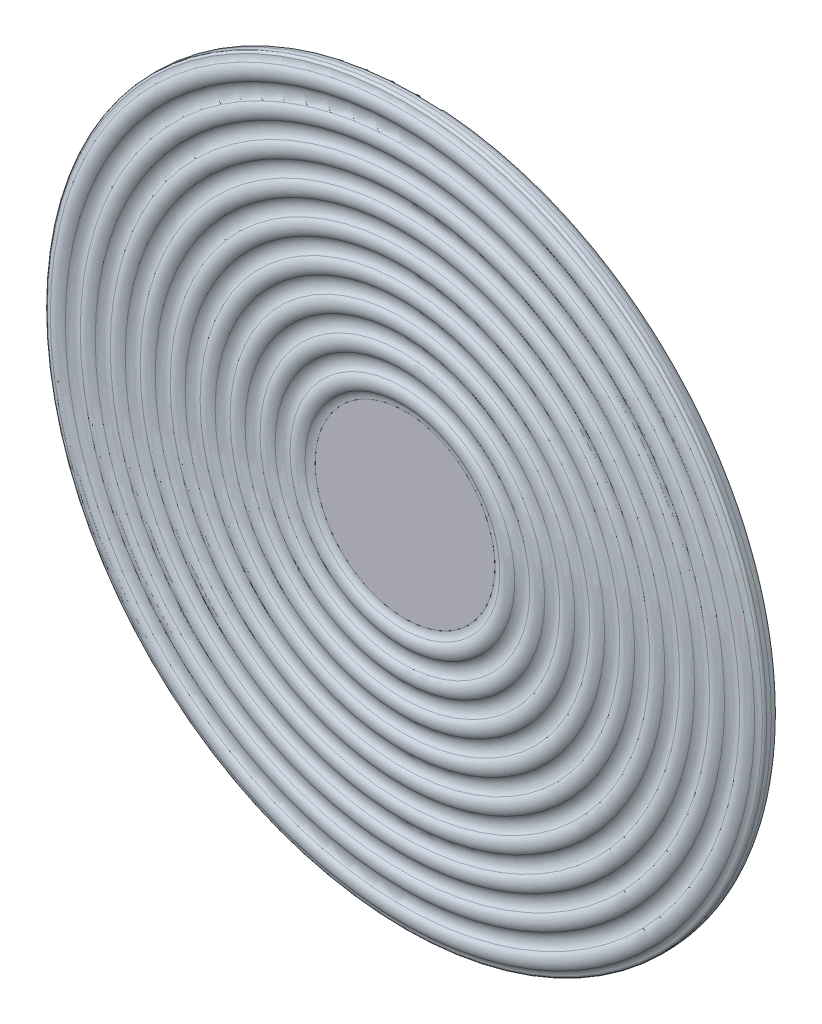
from build123d import *

# Parameters (mm, degrees)
CROQUIS1_R              = 50
SALIENTE_EXTRUIR1_DEPTH = 40
VACIADO1_T              = -3
CORTAR_EXTRUIR1_DEPTH   = 82.240384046
MATRIZL1_COUNT          = 3
MATRIZL1_PITCH          = 5
MATRIZL1_COL_COUNT      = 3
MATRIZL1_COL_PITCH      = 5
CROQUIS3_R              = 50
SALIENTE_EXTRUIR2_DEPTH = 26
CROQUIS5_R              = 37.5
SALIENTE_EXTRUIR3_DEPTH = 3
REDONDEO1_R             = 4
REDONDEO2_R             = 1


with BuildPart() as part:
    # Croquis1 → Saliente-Extruir1 (new body)
    with BuildSketch(Plane.XY):
        Circle(CROQUIS1_R)
    extrude(amount=SALIENTE_EXTRUIR1_DEPTH)

    # Vaciado1
    vaciado1_openings = [part.faces().sort_by_distance(p)[0] for p in [
        (0, 0, 0),
    ]]
    offset(amount=VACIADO1_T, openings=vaciado1_openings, kind=Kind.INTERSECTION)

    # Croquis2 → Cortar-Extruir1 (cut, symmetric)
    with BuildSketch(Plane(origin=(0, 0, 0), x_dir=(1, 0, 0), z_dir=(0, 1, 0))):
        with BuildLine():
            Line((-0.05, -10), (0.05, -10))
            ThreePointArc((0.05, -10), (0.898528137, -10.351471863), (1.25, -11.2))
            Line((1.25, -11.2), (1.25, -28.8))
            ThreePointArc((1.25, -28.8), (0.898528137, -29.648528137), (0.05, -30))
            Line((0.05, -30), (-0.05, -30))
            ThreePointArc((-0.05, -30), (-0.898528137, -29.648528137), (-1.25, -28.8))
            Line((-1.25, -28.8), (-1.25, -11.2))
            ThreePointArc((-1.25, -11.2), (-0.898528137, -10.351471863), (-0.05, -10))
        make_face()
    cortar_extruir1 = extrude(amount=CORTAR_EXTRUIR1_DEPTH, both=True, mode=Mode.SUBTRACT)

    # MatrizL1: Cortar-Extruir1 ×3
    with Locations(*[(i * MATRIZL1_PITCH, 0, 0) for i in range(1, MATRIZL1_COUNT)]):
        add(cortar_extruir1, mode=Mode.SUBTRACT)

    # MatrizL1 col: Cortar-Extruir1 ×3
    with Locations(*[(-i * MATRIZL1_COL_PITCH, 0, 0) for i in range(1, MATRIZL1_COL_COUNT)]):
        add(cortar_extruir1, mode=Mode.SUBTRACT)


with BuildPart() as body_2:
    # Croquis3 → Saliente-Extruir2 (new body)
    with BuildSketch(Plane.XY.offset(40)):
        with Locations(Location((0, 0, 0), (0, 0, 180))):
            Circle(CROQUIS3_R)
    extrude(amount=SALIENTE_EXTRUIR2_DEPTH)


with BuildPart() as body_3:
    # Croquis4 → Revoluci_n1 (revolve)
    with BuildSketch(Plane(origin=(0, 0, 0), x_dir=(0, 0, -1), z_dir=(1, 0, 0)), mode=Mode.PRIVATE) as revoluci_n1_sk:
        with BuildLine():
            Line((-72.806247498, 37.5), (-66, 37.5))
            Line((-66, 37.5), (-66, 150))
            Line((-66, 150), (-72.806247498, 150))
            ThreePointArc((-72.806247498, 150), (-73.088429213, 148.344043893), (-73.903123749, 146.875))
            ThreePointArc((-73.903123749, 146.875), (-75, 143.75), (-73.903123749, 140.625))
            ThreePointArc((-73.903123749, 140.625), (-72.806247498, 137.5), (-73.903123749, 134.375))
            ThreePointArc((-73.903123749, 134.375), (-75, 131.25), (-73.903123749, 128.125))
            ThreePointArc((-73.903123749, 128.125), (-72.806247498, 125), (-73.903123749, 121.875))
            ThreePointArc((-73.903123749, 121.875), (-75, 118.75), (-73.903123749, 115.625))
            ThreePointArc((-73.903123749, 115.625), (-72.806247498, 112.5), (-73.903123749, 109.375))
            ThreePointArc((-73.903123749, 109.375), (-75, 106.25), (-73.903123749, 103.125))
            ThreePointArc((-73.903123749, 103.125), (-72.806247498, 100), (-73.903123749, 96.875))
            ThreePointArc((-73.903123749, 96.875), (-75, 93.75), (-73.903123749, 90.625))
            ThreePointArc((-73.903123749, 90.625), (-72.806247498, 87.5), (-73.903123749, 84.375))
            ThreePointArc((-73.903123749, 84.375), (-75, 81.25), (-73.903123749, 78.125))
            ThreePointArc((-73.903123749, 78.125), (-72.806247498, 75), (-73.903123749, 71.875))
            ThreePointArc((-73.903123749, 71.875), (-75, 68.75), (-73.903123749, 65.625))
            ThreePointArc((-73.903123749, 65.625), (-72.806247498, 62.5), (-73.903123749, 59.375))
            ThreePointArc((-73.903123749, 59.375), (-75, 56.25), (-73.903123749, 53.125))
            ThreePointArc((-73.903123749, 53.125), (-72.806247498, 50), (-73.903123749, 46.875))
            ThreePointArc((-73.903123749, 46.875), (-75, 43.75), (-73.903123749, 40.625))
            ThreePointArc((-73.903123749, 40.625), (-73.088429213, 39.155956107), (-72.806247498, 37.5))
        make_face()
    revolve(revoluci_n1_sk.sketch.rotate(Axis((0, 0, 0), (0, 0, 1)), 90), axis=Axis((0, 0, 0), (0, 0, 1)))

    # Redondeo1
    redondeo1_edges = [body_3.edges().sort_by_distance(p)[0] for p in [
        (150, 0, 66),
    ]]
    fillet(redondeo1_edges, radius=REDONDEO1_R)

    # Redondeo2
    redondeo2_edges = [body_3.edges().sort_by_distance(p)[0] for p in [
        (150, 0, 72.806247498),
    ]]
    fillet(redondeo2_edges, radius=REDONDEO2_R)


with BuildPart() as body_4:
    # Croquis5 → Saliente-Extruir3 (new body)
    with BuildSketch(Plane.XY.offset(72.806247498)):
        Circle(CROQUIS5_R)
    extrude(amount=-SALIENTE_EXTRUIR3_DEPTH)


solid = Compound([part.part, body_2.part, body_3.part, body_4.part])
